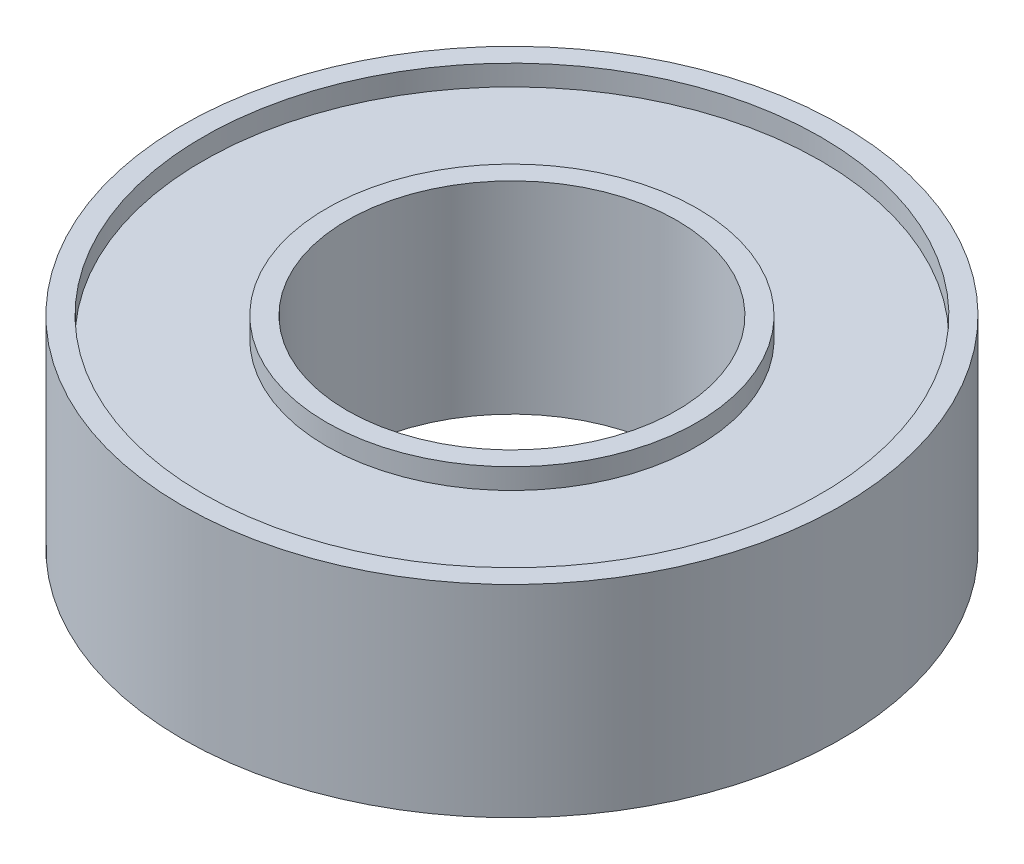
ISO-10303-21;
HEADER;
FILE_DESCRIPTION(('STEP AP214'),'2;1');
FILE_NAME('part.step','',(''),(''),'','','');
FILE_SCHEMA(('AUTOMOTIVE_DESIGN { 1 0 10303 214 1 1 1 1 }'));
ENDSEC;
DATA;
#1=APPLICATION_CONTEXT('core data for automotive mechanical design processes');
#2=APPLICATION_PROTOCOL_DEFINITION('international standard','automotive_design',2000,#1);
#3=PRODUCT_CONTEXT('',#1,'mechanical');
#4=PRODUCT('Part','Part','',(#3));
#5=PRODUCT_RELATED_PRODUCT_CATEGORY('part','',(#4));
#6=PRODUCT_DEFINITION_FORMATION('','',#4);
#7=PRODUCT_DEFINITION_CONTEXT('part definition',#1,'design');
#8=PRODUCT_DEFINITION('design','',#6,#7);
#9=PRODUCT_DEFINITION_SHAPE('','',#8);
#10=(LENGTH_UNIT() NAMED_UNIT(*) SI_UNIT(.MILLI.,.METRE.));
#11=(NAMED_UNIT(*) PLANE_ANGLE_UNIT() SI_UNIT($,.RADIAN.));
#12=(NAMED_UNIT(*) SI_UNIT($,.STERADIAN.) SOLID_ANGLE_UNIT());
#13=UNCERTAINTY_MEASURE_WITH_UNIT(LENGTH_MEASURE(1.E-05),#10,'distance_accuracy_value','');
#14=(GEOMETRIC_REPRESENTATION_CONTEXT(3) GLOBAL_UNCERTAINTY_ASSIGNED_CONTEXT((#13)) GLOBAL_UNIT_ASSIGNED_CONTEXT((#10,
#11,#12)) REPRESENTATION_CONTEXT('',''));
#15=CARTESIAN_POINT('',(0.,0.,0.));
#16=DIRECTION('',(0.,0.,1.));
#17=DIRECTION('',(1.,0.,0.));
#18=AXIS2_PLACEMENT_3D('',#15,#16,#17);
#19=CARTESIAN_POINT('',(-11.3367826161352,0.,-8.99124138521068));
#20=DIRECTION('',(0.,1.,0.));
#21=DIRECTION('',(0.,0.,1.));
#22=AXIS2_PLACEMENT_3D('',#19,#20,#21);
#23=PLANE('',#22);
#24=CARTESIAN_POINT('',(-11.3367826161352,0.,-8.99124138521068));
#25=DIRECTION('',(0.,1.,0.));
#26=DIRECTION('',(0.,0.,1.));
#27=AXIS2_PLACEMENT_3D('',#24,#25,#26);
#28=CIRCLE('',#27,3.175);
#29=CARTESIAN_POINT('',(-11.3367826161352,0.,-5.81624138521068));
#30=VERTEX_POINT('',#29);
#31=EDGE_CURVE('E42',#30,#30,#28,.T.);
#32=ORIENTED_EDGE('',*,*,#31,.T.);
#33=EDGE_LOOP('',(#32));
#34=FACE_BOUND('',#33,.T.);
#35=CARTESIAN_POINT('',(-11.3367826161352,0.,-8.99124138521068));
#36=DIRECTION('',(0.,-1.,0.));
#37=DIRECTION('',(0.,0.,-1.));
#38=AXIS2_PLACEMENT_3D('',#35,#36,#37);
#39=CIRCLE('',#38,3.571875);
#40=CARTESIAN_POINT('',(-11.3367826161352,0.,-12.5631163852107));
#41=VERTEX_POINT('',#40);
#42=EDGE_CURVE('E66',#41,#41,#39,.T.);
#43=ORIENTED_EDGE('',*,*,#42,.T.);
#44=EDGE_LOOP('',(#43));
#45=FACE_BOUND('',#44,.T.);
#46=ADVANCED_FACE('F29',(#34,#45),#23,.F.);
#47=CARTESIAN_POINT('',(-11.3367826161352,3.89255,-8.99124138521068));
#48=DIRECTION('',(0.,1.,0.));
#49=DIRECTION('',(0.,0.,1.));
#50=AXIS2_PLACEMENT_3D('',#47,#48,#49);
#51=PLANE('',#50);
#52=CARTESIAN_POINT('',(-11.3367826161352,3.89255,-8.99124138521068));
#53=DIRECTION('',(0.,1.,0.));
#54=DIRECTION('',(0.,0.,1.));
#55=AXIS2_PLACEMENT_3D('',#52,#53,#54);
#56=CIRCLE('',#55,3.175);
#57=CARTESIAN_POINT('',(-11.3367826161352,3.89255,-5.81624138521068));
#58=VERTEX_POINT('',#57);
#59=EDGE_CURVE('E40',#58,#58,#56,.T.);
#60=ORIENTED_EDGE('',*,*,#59,.F.);
#61=EDGE_LOOP('',(#60));
#62=FACE_BOUND('',#61,.T.);
#63=CARTESIAN_POINT('',(-11.3367826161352,3.89255,-8.99124138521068));
#64=DIRECTION('',(0.,1.,0.));
#65=DIRECTION('',(0.,0.,1.));
#66=AXIS2_PLACEMENT_3D('',#63,#64,#65);
#67=CIRCLE('',#66,3.571875);
#68=CARTESIAN_POINT('',(-11.3367826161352,3.89255,-5.41936638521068));
#69=VERTEX_POINT('',#68);
#70=EDGE_CURVE('E54',#69,#69,#67,.T.);
#71=ORIENTED_EDGE('',*,*,#70,.T.);
#72=EDGE_LOOP('',(#71));
#73=FACE_BOUND('',#72,.T.);
#74=ADVANCED_FACE('F104',(#62,#73),#51,.T.);
#75=CARTESIAN_POINT('',(-11.3367826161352,3.89255,-8.99124138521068));
#76=DIRECTION('',(0.,1.,0.));
#77=DIRECTION('',(0.,0.,1.));
#78=AXIS2_PLACEMENT_3D('',#75,#76,#77);
#79=CIRCLE('',#78,5.953125);
#80=CARTESIAN_POINT('',(-11.3367826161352,3.89255,-3.03811638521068));
#81=VERTEX_POINT('',#80);
#82=EDGE_CURVE('E48',#81,#81,#79,.T.);
#83=ORIENTED_EDGE('',*,*,#82,.F.);
#84=EDGE_LOOP('',(#83));
#85=FACE_BOUND('',#84,.T.);
#86=CARTESIAN_POINT('',(-11.3367826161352,3.89255,-8.99124138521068));
#87=DIRECTION('',(0.,1.,0.));
#88=DIRECTION('',(0.,0.,1.));
#89=AXIS2_PLACEMENT_3D('',#86,#87,#88);
#90=CIRCLE('',#89,6.35);
#91=CARTESIAN_POINT('',(-11.3367826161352,3.89255,-2.64124138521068));
#92=VERTEX_POINT('',#91);
#93=EDGE_CURVE('E10',#92,#92,#90,.T.);
#94=ORIENTED_EDGE('',*,*,#93,.T.);
#95=EDGE_LOOP('',(#94));
#96=FACE_BOUND('',#95,.T.);
#97=ADVANCED_FACE('F91',(#85,#96),#51,.T.);
#98=CARTESIAN_POINT('',(-11.3367826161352,0.,-8.99124138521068));
#99=DIRECTION('',(0.,-1.,0.));
#100=DIRECTION('',(0.,0.,-1.));
#101=AXIS2_PLACEMENT_3D('',#98,#99,#100);
#102=CIRCLE('',#101,5.953125);
#103=CARTESIAN_POINT('',(-11.3367826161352,0.,-14.9443663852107));
#104=VERTEX_POINT('',#103);
#105=EDGE_CURVE('E60',#104,#104,#102,.T.);
#106=ORIENTED_EDGE('',*,*,#105,.F.);
#107=EDGE_LOOP('',(#106));
#108=FACE_BOUND('',#107,.T.);
#109=CARTESIAN_POINT('',(-11.3367826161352,0.,-8.99124138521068));
#110=DIRECTION('',(0.,1.,0.));
#111=DIRECTION('',(0.,0.,1.));
#112=AXIS2_PLACEMENT_3D('',#109,#110,#111);
#113=CIRCLE('',#112,6.35);
#114=CARTESIAN_POINT('',(-11.3367826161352,0.,-2.64124138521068));
#115=VERTEX_POINT('',#114);
#116=EDGE_CURVE('E33',#115,#115,#113,.T.);
#117=ORIENTED_EDGE('',*,*,#116,.F.);
#118=EDGE_LOOP('',(#117));
#119=FACE_BOUND('',#118,.T.);
#120=ADVANCED_FACE('F88',(#108,#119),#23,.F.);
#121=CARTESIAN_POINT('',(-11.3367826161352,3.89255,-8.99124138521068));
#122=DIRECTION('',(0.,-1.,0.));
#123=DIRECTION('',(0.,0.,-1.));
#124=AXIS2_PLACEMENT_3D('',#121,#122,#123);
#125=CYLINDRICAL_SURFACE('',#124,6.35);
#126=ORIENTED_EDGE('',*,*,#93,.F.);
#127=EDGE_LOOP('',(#126));
#128=FACE_BOUND('',#127,.T.);
#129=ORIENTED_EDGE('',*,*,#116,.T.);
#130=EDGE_LOOP('',(#129));
#131=FACE_BOUND('',#130,.T.);
#132=ADVANCED_FACE('F31',(#128,#131),#125,.T.);
#133=CARTESIAN_POINT('',(-11.3367826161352,3.89255,-8.99124138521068));
#134=DIRECTION('',(0.,-1.,0.));
#135=DIRECTION('',(0.,0.,-1.));
#136=AXIS2_PLACEMENT_3D('',#133,#134,#135);
#137=CYLINDRICAL_SURFACE('',#136,3.175);
#138=ORIENTED_EDGE('',*,*,#59,.T.);
#139=EDGE_LOOP('',(#138));
#140=FACE_BOUND('',#139,.T.);
#141=ORIENTED_EDGE('',*,*,#31,.F.);
#142=EDGE_LOOP('',(#141));
#143=FACE_BOUND('',#142,.T.);
#144=ADVANCED_FACE('F95',(#140,#143),#137,.F.);
#145=CARTESIAN_POINT('',(-11.3367826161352,3.495675,-8.99124138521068));
#146=DIRECTION('',(0.,1.,0.));
#147=DIRECTION('',(0.,0.,1.));
#148=AXIS2_PLACEMENT_3D('',#145,#146,#147);
#149=CYLINDRICAL_SURFACE('',#148,5.953125);
#150=CARTESIAN_POINT('',(-11.3367826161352,3.495675,-8.99124138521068));
#151=DIRECTION('',(0.,1.,0.));
#152=DIRECTION('',(0.,0.,1.));
#153=AXIS2_PLACEMENT_3D('',#150,#151,#152);
#154=CIRCLE('',#153,5.953125);
#155=CARTESIAN_POINT('',(-11.3367826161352,3.495675,-3.03811638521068));
#156=VERTEX_POINT('',#155);
#157=EDGE_CURVE('E45',#156,#156,#154,.T.);
#158=ORIENTED_EDGE('',*,*,#157,.F.);
#159=EDGE_LOOP('',(#158));
#160=FACE_BOUND('',#159,.T.);
#161=ORIENTED_EDGE('',*,*,#82,.T.);
#162=EDGE_LOOP('',(#161));
#163=FACE_BOUND('',#162,.T.);
#164=ADVANCED_FACE('F100',(#160,#163),#149,.F.);
#165=CARTESIAN_POINT('',(-11.3367826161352,3.495675,-8.99124138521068));
#166=DIRECTION('',(0.,1.,0.));
#167=DIRECTION('',(0.,0.,1.));
#168=AXIS2_PLACEMENT_3D('',#165,#166,#167);
#169=PLANE('',#168);
#170=CARTESIAN_POINT('',(-11.3367826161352,3.495675,-8.99124138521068));
#171=DIRECTION('',(0.,1.,0.));
#172=DIRECTION('',(0.,0.,1.));
#173=AXIS2_PLACEMENT_3D('',#170,#171,#172);
#174=CIRCLE('',#173,3.571875);
#175=CARTESIAN_POINT('',(-11.3367826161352,3.495675,-5.41936638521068));
#176=VERTEX_POINT('',#175);
#177=EDGE_CURVE('E51',#176,#176,#174,.T.);
#178=ORIENTED_EDGE('',*,*,#177,.F.);
#179=EDGE_LOOP('',(#178));
#180=FACE_BOUND('',#179,.T.);
#181=ORIENTED_EDGE('',*,*,#157,.T.);
#182=EDGE_LOOP('',(#181));
#183=FACE_BOUND('',#182,.T.);
#184=ADVANCED_FACE('F117',(#180,#183),#169,.T.);
#185=CARTESIAN_POINT('',(-11.3367826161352,3.495675,-8.99124138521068));
#186=DIRECTION('',(0.,1.,0.));
#187=DIRECTION('',(0.,0.,1.));
#188=AXIS2_PLACEMENT_3D('',#185,#186,#187);
#189=CYLINDRICAL_SURFACE('',#188,3.571875);
#190=ORIENTED_EDGE('',*,*,#177,.T.);
#191=EDGE_LOOP('',(#190));
#192=FACE_BOUND('',#191,.T.);
#193=ORIENTED_EDGE('',*,*,#70,.F.);
#194=EDGE_LOOP('',(#193));
#195=FACE_BOUND('',#194,.T.);
#196=ADVANCED_FACE('F84',(#192,#195),#189,.T.);
#197=CARTESIAN_POINT('',(-11.3367826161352,0.396875,-8.99124138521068));
#198=DIRECTION('',(0.,-1.,0.));
#199=DIRECTION('',(0.,0.,-1.));
#200=AXIS2_PLACEMENT_3D('',#197,#198,#199);
#201=CYLINDRICAL_SURFACE('',#200,5.953125);
#202=CARTESIAN_POINT('',(-11.3367826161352,0.396875,-8.99124138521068));
#203=DIRECTION('',(0.,-1.,0.));
#204=DIRECTION('',(0.,0.,-1.));
#205=AXIS2_PLACEMENT_3D('',#202,#203,#204);
#206=CIRCLE('',#205,5.953125);
#207=CARTESIAN_POINT('',(-11.3367826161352,0.396875,-14.9443663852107));
#208=VERTEX_POINT('',#207);
#209=EDGE_CURVE('E57',#208,#208,#206,.T.);
#210=ORIENTED_EDGE('',*,*,#209,.F.);
#211=EDGE_LOOP('',(#210));
#212=FACE_BOUND('',#211,.T.);
#213=ORIENTED_EDGE('',*,*,#105,.T.);
#214=EDGE_LOOP('',(#213));
#215=FACE_BOUND('',#214,.T.);
#216=ADVANCED_FACE('F78',(#212,#215),#201,.F.);
#217=CARTESIAN_POINT('',(-11.3367826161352,0.396875,-8.99124138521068));
#218=DIRECTION('',(0.,-1.,0.));
#219=DIRECTION('',(0.,0.,-1.));
#220=AXIS2_PLACEMENT_3D('',#217,#218,#219);
#221=PLANE('',#220);
#222=CARTESIAN_POINT('',(-11.3367826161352,0.396875,-8.99124138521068));
#223=DIRECTION('',(0.,-1.,0.));
#224=DIRECTION('',(0.,0.,-1.));
#225=AXIS2_PLACEMENT_3D('',#222,#223,#224);
#226=CIRCLE('',#225,3.571875);
#227=CARTESIAN_POINT('',(-11.3367826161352,0.396875,-12.5631163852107));
#228=VERTEX_POINT('',#227);
#229=EDGE_CURVE('E63',#228,#228,#226,.T.);
#230=ORIENTED_EDGE('',*,*,#229,.F.);
#231=EDGE_LOOP('',(#230));
#232=FACE_BOUND('',#231,.T.);
#233=ORIENTED_EDGE('',*,*,#209,.T.);
#234=EDGE_LOOP('',(#233));
#235=FACE_BOUND('',#234,.T.);
#236=ADVANCED_FACE('F75',(#232,#235),#221,.T.);
#237=CARTESIAN_POINT('',(-11.3367826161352,0.396875,-8.99124138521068));
#238=DIRECTION('',(0.,-1.,0.));
#239=DIRECTION('',(0.,0.,-1.));
#240=AXIS2_PLACEMENT_3D('',#237,#238,#239);
#241=CYLINDRICAL_SURFACE('',#240,3.571875);
#242=ORIENTED_EDGE('',*,*,#229,.T.);
#243=EDGE_LOOP('',(#242));
#244=FACE_BOUND('',#243,.T.);
#245=ORIENTED_EDGE('',*,*,#42,.F.);
#246=EDGE_LOOP('',(#245));
#247=FACE_BOUND('',#246,.T.);
#248=ADVANCED_FACE('F72',(#244,#247),#241,.T.);
#249=CLOSED_SHELL('',(#46,#74,#97,#120,#132,#144,#164,#184,#196,#216,#236,#248));
#250=MANIFOLD_SOLID_BREP('B2',#249);
#251=ADVANCED_BREP_SHAPE_REPRESENTATION('',(#18,#250),#14);
#252=SHAPE_DEFINITION_REPRESENTATION(#9,#251);
ENDSEC;
END-ISO-10303-21;
